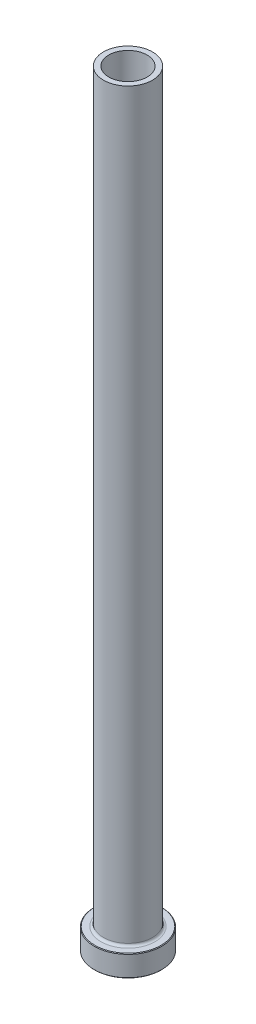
ISO-10303-21;
HEADER;
FILE_DESCRIPTION(('STEP AP214'),'2;1');
FILE_NAME('part.step','',(''),(''),'','','');
FILE_SCHEMA(('AUTOMOTIVE_DESIGN { 1 0 10303 214 1 1 1 1 }'));
ENDSEC;
DATA;
#1=APPLICATION_CONTEXT('core data for automotive mechanical design processes');
#2=APPLICATION_PROTOCOL_DEFINITION('international standard','automotive_design',2000,#1);
#3=PRODUCT_CONTEXT('',#1,'mechanical');
#4=PRODUCT('Part','Part','',(#3));
#5=PRODUCT_RELATED_PRODUCT_CATEGORY('part','',(#4));
#6=PRODUCT_DEFINITION_FORMATION('','',#4);
#7=PRODUCT_DEFINITION_CONTEXT('part definition',#1,'design');
#8=PRODUCT_DEFINITION('design','',#6,#7);
#9=PRODUCT_DEFINITION_SHAPE('','',#8);
#10=(LENGTH_UNIT() NAMED_UNIT(*) SI_UNIT(.MILLI.,.METRE.));
#11=(NAMED_UNIT(*) PLANE_ANGLE_UNIT() SI_UNIT($,.RADIAN.));
#12=(NAMED_UNIT(*) SI_UNIT($,.STERADIAN.) SOLID_ANGLE_UNIT());
#13=UNCERTAINTY_MEASURE_WITH_UNIT(LENGTH_MEASURE(1.E-05),#10,'distance_accuracy_value','');
#14=(GEOMETRIC_REPRESENTATION_CONTEXT(3) GLOBAL_UNCERTAINTY_ASSIGNED_CONTEXT((#13)) GLOBAL_UNIT_ASSIGNED_CONTEXT((#10,
#11,#12)) REPRESENTATION_CONTEXT('',''));
#15=CARTESIAN_POINT('',(0.,0.,0.));
#16=DIRECTION('',(0.,0.,1.));
#17=DIRECTION('',(1.,0.,0.));
#18=AXIS2_PLACEMENT_3D('',#15,#16,#17);
#19=CARTESIAN_POINT('',(0.,92.1876809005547,0.));
#20=DIRECTION('',(0.,1.,0.));
#21=DIRECTION('',(0.,0.,1.));
#22=AXIS2_PLACEMENT_3D('',#19,#20,#21);
#23=CYLINDRICAL_SURFACE('',#22,6.25000000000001);
#24=CARTESIAN_POINT('',(0.,250.,0.));
#25=DIRECTION('',(0.,1.,0.));
#26=DIRECTION('',(0.,0.,1.));
#27=AXIS2_PLACEMENT_3D('',#24,#25,#26);
#28=CIRCLE('',#27,6.25000000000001);
#29=CARTESIAN_POINT('',(0.,250.,6.25000000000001));
#30=VERTEX_POINT('',#29);
#31=EDGE_CURVE('E62',#30,#30,#28,.T.);
#32=ORIENTED_EDGE('',*,*,#31,.T.);
#33=EDGE_LOOP('',(#32));
#34=FACE_BOUND('',#33,.T.);
#35=CARTESIAN_POINT('',(0.,195.,0.));
#36=DIRECTION('',(0.,1.,0.));
#37=DIRECTION('',(0.,0.,1.));
#38=AXIS2_PLACEMENT_3D('',#35,#36,#37);
#39=CIRCLE('',#38,6.25000000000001);
#40=CARTESIAN_POINT('',(0.,195.,6.25000000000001));
#41=VERTEX_POINT('',#40);
#42=EDGE_CURVE('E71',#41,#41,#39,.T.);
#43=ORIENTED_EDGE('',*,*,#42,.F.);
#44=EDGE_LOOP('',(#43));
#45=FACE_BOUND('',#44,.T.);
#46=ADVANCED_FACE('F30',(#34,#45),#23,.F.);
#47=CARTESIAN_POINT('',(-6.25000000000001,250.,0.));
#48=DIRECTION('',(0.,1.,0.));
#49=DIRECTION('',(0.,0.,1.));
#50=AXIS2_PLACEMENT_3D('',#47,#48,#49);
#51=PLANE('',#50);
#52=CARTESIAN_POINT('',(0.,250.,0.));
#53=DIRECTION('',(0.,1.,0.));
#54=DIRECTION('',(0.,0.,1.));
#55=AXIS2_PLACEMENT_3D('',#52,#53,#54);
#56=CIRCLE('',#55,8.00000000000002);
#57=CARTESIAN_POINT('',(0.,250.,8.00000000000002));
#58=VERTEX_POINT('',#57);
#59=EDGE_CURVE('E65',#58,#58,#56,.T.);
#60=ORIENTED_EDGE('',*,*,#59,.T.);
#61=EDGE_LOOP('',(#60));
#62=FACE_BOUND('',#61,.T.);
#63=ORIENTED_EDGE('',*,*,#31,.F.);
#64=EDGE_LOOP('',(#63));
#65=FACE_BOUND('',#64,.T.);
#66=ADVANCED_FACE('F79',(#62,#65),#51,.T.);
#67=CARTESIAN_POINT('',(0.,92.1876809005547,0.));
#68=DIRECTION('',(0.,1.,0.));
#69=DIRECTION('',(0.,0.,1.));
#70=AXIS2_PLACEMENT_3D('',#67,#68,#69);
#71=CYLINDRICAL_SURFACE('',#70,8.);
#72=CARTESIAN_POINT('',(0.,7.8,0.));
#73=DIRECTION('',(0.,1.,0.));
#74=DIRECTION('',(0.,0.,1.));
#75=AXIS2_PLACEMENT_3D('',#72,#73,#74);
#76=CIRCLE('',#75,8.);
#77=CARTESIAN_POINT('',(0.,7.8,8.));
#78=VERTEX_POINT('',#77);
#79=EDGE_CURVE('E59',#78,#78,#76,.T.);
#80=ORIENTED_EDGE('',*,*,#79,.T.);
#81=EDGE_LOOP('',(#80));
#82=FACE_BOUND('',#81,.T.);
#83=ORIENTED_EDGE('',*,*,#59,.F.);
#84=EDGE_LOOP('',(#83));
#85=FACE_BOUND('',#84,.T.);
#86=ADVANCED_FACE('F85',(#82,#85),#71,.T.);
#87=CARTESIAN_POINT('',(-7.99999999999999,7.,0.));
#88=DIRECTION('',(0.,1.,0.));
#89=DIRECTION('',(0.,0.,1.));
#90=AXIS2_PLACEMENT_3D('',#87,#88,#89);
#91=PLANE('',#90);
#92=CARTESIAN_POINT('',(0.,7.,0.));
#93=DIRECTION('',(0.,1.,0.));
#94=DIRECTION('',(0.,0.,1.));
#95=AXIS2_PLACEMENT_3D('',#92,#93,#94);
#96=CIRCLE('',#95,10.8);
#97=CARTESIAN_POINT('',(0.,7.,10.8));
#98=VERTEX_POINT('',#97);
#99=EDGE_CURVE('E53',#98,#98,#96,.T.);
#100=ORIENTED_EDGE('',*,*,#99,.T.);
#101=EDGE_LOOP('',(#100));
#102=FACE_BOUND('',#101,.T.);
#103=CARTESIAN_POINT('',(0.,7.,0.));
#104=DIRECTION('',(0.,1.,0.));
#105=DIRECTION('',(0.,0.,1.));
#106=AXIS2_PLACEMENT_3D('',#103,#104,#105);
#107=CIRCLE('',#106,8.8);
#108=CARTESIAN_POINT('',(0.,7.,8.8));
#109=VERTEX_POINT('',#108);
#110=EDGE_CURVE('E56',#109,#109,#107,.F.);
#111=ORIENTED_EDGE('',*,*,#110,.T.);
#112=EDGE_LOOP('',(#111));
#113=FACE_BOUND('',#112,.T.);
#114=ADVANCED_FACE('F111',(#102,#113),#91,.T.);
#115=CARTESIAN_POINT('',(0.,92.1876809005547,0.));
#116=DIRECTION('',(0.,1.,0.));
#117=DIRECTION('',(0.,0.,1.));
#118=AXIS2_PLACEMENT_3D('',#115,#116,#117);
#119=CYLINDRICAL_SURFACE('',#118,11.);
#120=CARTESIAN_POINT('',(0.,6.79999999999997,0.));
#121=DIRECTION('',(0.,1.,0.));
#122=DIRECTION('',(0.,0.,1.));
#123=AXIS2_PLACEMENT_3D('',#120,#121,#122);
#124=CIRCLE('',#123,11.);
#125=CARTESIAN_POINT('',(0.,6.79999999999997,11.));
#126=VERTEX_POINT('',#125);
#127=EDGE_CURVE('E45',#126,#126,#124,.F.);
#128=ORIENTED_EDGE('',*,*,#127,.T.);
#129=EDGE_LOOP('',(#128));
#130=FACE_BOUND('',#129,.T.);
#131=CARTESIAN_POINT('',(0.,0.200000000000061,0.));
#132=DIRECTION('',(0.,-1.,0.));
#133=DIRECTION('',(0.,0.,-1.));
#134=AXIS2_PLACEMENT_3D('',#131,#132,#133);
#135=CIRCLE('',#134,11.);
#136=CARTESIAN_POINT('',(0.,0.200000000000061,-11.));
#137=VERTEX_POINT('',#136);
#138=EDGE_CURVE('E50',#137,#137,#135,.F.);
#139=ORIENTED_EDGE('',*,*,#138,.T.);
#140=EDGE_LOOP('',(#139));
#141=FACE_BOUND('',#140,.T.);
#142=ADVANCED_FACE('F108',(#130,#141),#119,.T.);
#143=CARTESIAN_POINT('',(-11.,0.,0.));
#144=DIRECTION('',(0.,-1.,0.));
#145=DIRECTION('',(0.,0.,-1.));
#146=AXIS2_PLACEMENT_3D('',#143,#144,#145);
#147=PLANE('',#146);
#148=CARTESIAN_POINT('',(0.,0.,0.));
#149=DIRECTION('',(0.,-1.,0.));
#150=DIRECTION('',(0.,0.,-1.));
#151=AXIS2_PLACEMENT_3D('',#148,#149,#150);
#152=CIRCLE('',#151,7.00000000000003);
#153=CARTESIAN_POINT('',(0.,0.,-7.00000000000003));
#154=VERTEX_POINT('',#153);
#155=EDGE_CURVE('E37',#154,#154,#152,.F.);
#156=ORIENTED_EDGE('',*,*,#155,.T.);
#157=EDGE_LOOP('',(#156));
#158=FACE_BOUND('',#157,.T.);
#159=CARTESIAN_POINT('',(0.,0.,0.));
#160=DIRECTION('',(0.,-1.,0.));
#161=DIRECTION('',(0.,0.,-1.));
#162=AXIS2_PLACEMENT_3D('',#159,#160,#161);
#163=CIRCLE('',#162,10.7999999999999);
#164=CARTESIAN_POINT('',(0.,0.,-10.7999999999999));
#165=VERTEX_POINT('',#164);
#166=EDGE_CURVE('E41',#165,#165,#163,.T.);
#167=ORIENTED_EDGE('',*,*,#166,.T.);
#168=EDGE_LOOP('',(#167));
#169=FACE_BOUND('',#168,.T.);
#170=ADVANCED_FACE('F110',(#158,#169),#147,.T.);
#171=CARTESIAN_POINT('',(0.,92.1876809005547,0.));
#172=DIRECTION('',(0.,1.,0.));
#173=DIRECTION('',(0.,0.,1.));
#174=AXIS2_PLACEMENT_3D('',#171,#172,#173);
#175=CYLINDRICAL_SURFACE('',#174,6.5);
#176=CARTESIAN_POINT('',(0.,0.500000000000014,0.));
#177=DIRECTION('',(0.,-1.,0.));
#178=DIRECTION('',(0.,0.,-1.));
#179=AXIS2_PLACEMENT_3D('',#176,#177,#178);
#180=CIRCLE('',#179,6.5);
#181=CARTESIAN_POINT('',(0.,0.500000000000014,-6.5));
#182=VERTEX_POINT('',#181);
#183=EDGE_CURVE('E10',#182,#182,#180,.T.);
#184=ORIENTED_EDGE('',*,*,#183,.T.);
#185=EDGE_LOOP('',(#184));
#186=FACE_BOUND('',#185,.T.);
#187=CARTESIAN_POINT('',(0.,183.,0.));
#188=DIRECTION('',(0.,1.,0.));
#189=DIRECTION('',(0.,0.,1.));
#190=AXIS2_PLACEMENT_3D('',#187,#188,#189);
#191=CIRCLE('',#190,6.50000000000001);
#192=CARTESIAN_POINT('',(0.,183.,6.50000000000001));
#193=VERTEX_POINT('',#192);
#194=EDGE_CURVE('E68',#193,#193,#191,.T.);
#195=ORIENTED_EDGE('',*,*,#194,.T.);
#196=EDGE_LOOP('',(#195));
#197=FACE_BOUND('',#196,.T.);
#198=ADVANCED_FACE('F118',(#186,#197),#175,.F.);
#199=CARTESIAN_POINT('',(0.,183.,0.));
#200=DIRECTION('',(0.,-1.,0.));
#201=DIRECTION('',(0.,0.,-1.));
#202=AXIS2_PLACEMENT_3D('',#199,#200,#201);
#203=CONICAL_SURFACE('',#202,6.50000000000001,0.0208303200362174);
#204=ORIENTED_EDGE('',*,*,#42,.T.);
#205=EDGE_LOOP('',(#204));
#206=FACE_BOUND('',#205,.T.);
#207=ORIENTED_EDGE('',*,*,#194,.F.);
#208=EDGE_LOOP('',(#207));
#209=FACE_BOUND('',#208,.T.);
#210=ADVANCED_FACE('F75',(#206,#209),#203,.F.);
#211=CARTESIAN_POINT('',(0.,7.8,0.));
#212=DIRECTION('',(0.,1.,0.));
#213=DIRECTION('',(0.,0.,1.));
#214=AXIS2_PLACEMENT_3D('',#211,#212,#213);
#215=TOROIDAL_SURFACE('',#214,8.8,0.8);
#216=ORIENTED_EDGE('',*,*,#110,.F.);
#217=EDGE_LOOP('',(#216));
#218=FACE_BOUND('',#217,.T.);
#219=ORIENTED_EDGE('',*,*,#79,.F.);
#220=EDGE_LOOP('',(#219));
#221=FACE_BOUND('',#220,.T.);
#222=ADVANCED_FACE('F90',(#218,#221),#215,.F.);
#223=CARTESIAN_POINT('',(0.,7.00000000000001,0.));
#224=DIRECTION('',(0.,-1.,0.));
#225=DIRECTION('',(0.,0.,-1.));
#226=AXIS2_PLACEMENT_3D('',#223,#224,#225);
#227=CONICAL_SURFACE('',#226,10.7999999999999,0.785398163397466);
#228=ORIENTED_EDGE('',*,*,#127,.F.);
#229=EDGE_LOOP('',(#228));
#230=FACE_BOUND('',#229,.T.);
#231=ORIENTED_EDGE('',*,*,#99,.F.);
#232=EDGE_LOOP('',(#231));
#233=FACE_BOUND('',#232,.T.);
#234=ADVANCED_FACE('F93',(#230,#233),#227,.T.);
#235=CARTESIAN_POINT('',(0.,0.200000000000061,0.));
#236=DIRECTION('',(0.,1.,0.));
#237=DIRECTION('',(0.,0.,1.));
#238=AXIS2_PLACEMENT_3D('',#235,#236,#237);
#239=CONICAL_SURFACE('',#238,11.,0.785398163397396);
#240=ORIENTED_EDGE('',*,*,#166,.F.);
#241=EDGE_LOOP('',(#240));
#242=FACE_BOUND('',#241,.T.);
#243=ORIENTED_EDGE('',*,*,#138,.F.);
#244=EDGE_LOOP('',(#243));
#245=FACE_BOUND('',#244,.T.);
#246=ADVANCED_FACE('F96',(#242,#245),#239,.T.);
#247=CARTESIAN_POINT('',(0.,0.,0.));
#248=DIRECTION('',(0.,-1.,0.));
#249=DIRECTION('',(0.,0.,-1.));
#250=AXIS2_PLACEMENT_3D('',#247,#248,#249);
#251=CONICAL_SURFACE('',#250,7.00000000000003,0.785398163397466);
#252=ORIENTED_EDGE('',*,*,#183,.F.);
#253=EDGE_LOOP('',(#252));
#254=FACE_BOUND('',#253,.T.);
#255=ORIENTED_EDGE('',*,*,#155,.F.);
#256=EDGE_LOOP('',(#255));
#257=FACE_BOUND('',#256,.T.);
#258=ADVANCED_FACE('F32',(#254,#257),#251,.F.);
#259=CLOSED_SHELL('',(#46,#66,#86,#114,#142,#170,#198,#210,#222,#234,#246,#258));
#260=MANIFOLD_SOLID_BREP('B2',#259);
#261=ADVANCED_BREP_SHAPE_REPRESENTATION('',(#18,#260),#14);
#262=SHAPE_DEFINITION_REPRESENTATION(#9,#261);
ENDSEC;
END-ISO-10303-21;
